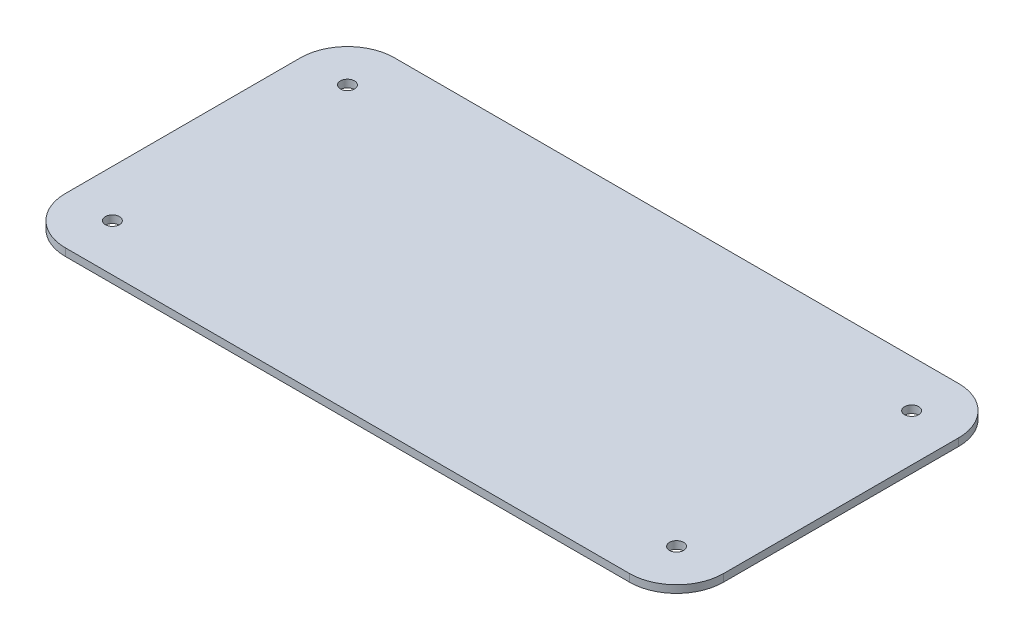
ISO-10303-21;
HEADER;
FILE_DESCRIPTION(('STEP AP214'),'2;1');
FILE_NAME('part.step','',(''),(''),'','','');
FILE_SCHEMA(('AUTOMOTIVE_DESIGN { 1 0 10303 214 1 1 1 1 }'));
ENDSEC;
DATA;
#1=APPLICATION_CONTEXT('core data for automotive mechanical design processes');
#2=APPLICATION_PROTOCOL_DEFINITION('international standard','automotive_design',2000,#1);
#3=PRODUCT_CONTEXT('',#1,'mechanical');
#4=PRODUCT('Part','Part','',(#3));
#5=PRODUCT_RELATED_PRODUCT_CATEGORY('part','',(#4));
#6=PRODUCT_DEFINITION_FORMATION('','',#4);
#7=PRODUCT_DEFINITION_CONTEXT('part definition',#1,'design');
#8=PRODUCT_DEFINITION('design','',#6,#7);
#9=PRODUCT_DEFINITION_SHAPE('','',#8);
#10=(LENGTH_UNIT() NAMED_UNIT(*) SI_UNIT(.MILLI.,.METRE.));
#11=(NAMED_UNIT(*) PLANE_ANGLE_UNIT() SI_UNIT($,.RADIAN.));
#12=(NAMED_UNIT(*) SI_UNIT($,.STERADIAN.) SOLID_ANGLE_UNIT());
#13=UNCERTAINTY_MEASURE_WITH_UNIT(LENGTH_MEASURE(1.E-05),#10,'distance_accuracy_value','');
#14=(GEOMETRIC_REPRESENTATION_CONTEXT(3) GLOBAL_UNCERTAINTY_ASSIGNED_CONTEXT((#13)) GLOBAL_UNIT_ASSIGNED_CONTEXT((#10,
#11,#12)) REPRESENTATION_CONTEXT('',''));
#15=CARTESIAN_POINT('',(0.,0.,0.));
#16=DIRECTION('',(0.,0.,1.));
#17=DIRECTION('',(1.,0.,0.));
#18=AXIS2_PLACEMENT_3D('',#15,#16,#17);
#19=CARTESIAN_POINT('',(50.,8.,-50.));
#20=DIRECTION('',(0.,-1.,0.));
#21=DIRECTION('',(0.,0.,-1.));
#22=AXIS2_PLACEMENT_3D('',#19,#20,#21);
#23=CYLINDRICAL_SURFACE('',#22,50.);
#24=CARTESIAN_POINT('',(50.,0.,-50.));
#25=DIRECTION('',(0.,1.,0.));
#26=DIRECTION('',(0.,0.,1.));
#27=AXIS2_PLACEMENT_3D('',#24,#25,#26);
#28=CIRCLE('',#27,50.);
#29=CARTESIAN_POINT('',(0.,0.,-50.0000000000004));
#30=VERTEX_POINT('',#29);
#31=CARTESIAN_POINT('',(50.0000000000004,0.,0.));
#32=VERTEX_POINT('',#31);
#33=EDGE_CURVE('E92',#30,#32,#28,.T.);
#34=ORIENTED_EDGE('',*,*,#33,.T.);
#35=DIRECTION('',(0.,-1.,0.));
#36=VECTOR('',#35,1.);
#37=CARTESIAN_POINT('',(50.0000000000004,8.,0.));
#38=LINE('',#37,#36);
#39=CARTESIAN_POINT('',(50.0000000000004,8.,0.));
#40=VERTEX_POINT('',#39);
#41=EDGE_CURVE('E11',#40,#32,#38,.T.);
#42=ORIENTED_EDGE('',*,*,#41,.F.);
#43=CARTESIAN_POINT('',(50.,8.,-50.));
#44=DIRECTION('',(0.,1.,0.));
#45=DIRECTION('',(0.,0.,1.));
#46=AXIS2_PLACEMENT_3D('',#43,#44,#45);
#47=CIRCLE('',#46,50.);
#48=CARTESIAN_POINT('',(0.,8.,-50.0000000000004));
#49=VERTEX_POINT('',#48);
#50=EDGE_CURVE('E124',#49,#40,#47,.T.);
#51=ORIENTED_EDGE('',*,*,#50,.F.);
#52=DIRECTION('',(0.,-1.,0.));
#53=VECTOR('',#52,1.);
#54=CARTESIAN_POINT('',(0.,8.,-50.0000000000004));
#55=LINE('',#54,#53);
#56=EDGE_CURVE('E105',#49,#30,#55,.T.);
#57=ORIENTED_EDGE('',*,*,#56,.T.);
#58=EDGE_LOOP('',(#34,#42,#51,#57));
#59=FACE_BOUND('',#58,.T.);
#60=ADVANCED_FACE('F24',(#59),#23,.T.);
#61=CARTESIAN_POINT('',(50.0000000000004,8.,0.));
#62=DIRECTION('',(0.,0.,-1.));
#63=DIRECTION('',(-1.,0.,0.));
#64=AXIS2_PLACEMENT_3D('',#61,#62,#63);
#65=PLANE('',#64);
#66=DIRECTION('',(1.,0.,0.));
#67=VECTOR('',#66,1.);
#68=CARTESIAN_POINT('',(50.0000000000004,0.,0.));
#69=LINE('',#68,#67);
#70=CARTESIAN_POINT('',(650.,0.,0.));
#71=VERTEX_POINT('',#70);
#72=EDGE_CURVE('E88',#32,#71,#69,.T.);
#73=ORIENTED_EDGE('',*,*,#72,.T.);
#74=DIRECTION('',(0.,-1.,0.));
#75=VECTOR('',#74,1.);
#76=CARTESIAN_POINT('',(650.,8.,0.));
#77=LINE('',#76,#75);
#78=CARTESIAN_POINT('',(650.,8.,0.));
#79=VERTEX_POINT('',#78);
#80=EDGE_CURVE('E31',#79,#71,#77,.T.);
#81=ORIENTED_EDGE('',*,*,#80,.F.);
#82=DIRECTION('',(1.,0.,0.));
#83=VECTOR('',#82,1.);
#84=CARTESIAN_POINT('',(50.0000000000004,8.,0.));
#85=LINE('',#84,#83);
#86=EDGE_CURVE('E101',#40,#79,#85,.T.);
#87=ORIENTED_EDGE('',*,*,#86,.F.);
#88=ORIENTED_EDGE('',*,*,#41,.T.);
#89=EDGE_LOOP('',(#73,#81,#87,#88));
#90=FACE_BOUND('',#89,.T.);
#91=ADVANCED_FACE('F100',(#90),#65,.F.);
#92=CARTESIAN_POINT('',(650.,8.,-50.));
#93=DIRECTION('',(0.,-1.,0.));
#94=DIRECTION('',(0.,0.,-1.));
#95=AXIS2_PLACEMENT_3D('',#92,#93,#94);
#96=CYLINDRICAL_SURFACE('',#95,50.);
#97=CARTESIAN_POINT('',(650.,0.,-50.));
#98=DIRECTION('',(0.,1.,0.));
#99=DIRECTION('',(0.,0.,1.));
#100=AXIS2_PLACEMENT_3D('',#97,#98,#99);
#101=CIRCLE('',#100,50.);
#102=CARTESIAN_POINT('',(700.,0.,-50.0000000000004));
#103=VERTEX_POINT('',#102);
#104=EDGE_CURVE('E94',#71,#103,#101,.T.);
#105=ORIENTED_EDGE('',*,*,#104,.T.);
#106=DIRECTION('',(0.,-1.,0.));
#107=VECTOR('',#106,1.);
#108=CARTESIAN_POINT('',(700.,8.,-50.0000000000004));
#109=LINE('',#108,#107);
#110=CARTESIAN_POINT('',(700.,8.,-50.0000000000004));
#111=VERTEX_POINT('',#110);
#112=EDGE_CURVE('E150',#111,#103,#109,.T.);
#113=ORIENTED_EDGE('',*,*,#112,.F.);
#114=CARTESIAN_POINT('',(650.,8.,-50.));
#115=DIRECTION('',(0.,1.,0.));
#116=DIRECTION('',(0.,0.,1.));
#117=AXIS2_PLACEMENT_3D('',#114,#115,#116);
#118=CIRCLE('',#117,50.);
#119=EDGE_CURVE('E127',#79,#111,#118,.T.);
#120=ORIENTED_EDGE('',*,*,#119,.F.);
#121=ORIENTED_EDGE('',*,*,#80,.T.);
#122=EDGE_LOOP('',(#105,#113,#120,#121));
#123=FACE_BOUND('',#122,.T.);
#124=ADVANCED_FACE('F154',(#123),#96,.T.);
#125=CARTESIAN_POINT('',(700.,8.,-50.0000000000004));
#126=DIRECTION('',(-1.,0.,0.));
#127=DIRECTION('',(0.,0.,1.));
#128=AXIS2_PLACEMENT_3D('',#125,#126,#127);
#129=PLANE('',#128);
#130=DIRECTION('',(0.,0.,-1.));
#131=VECTOR('',#130,1.);
#132=CARTESIAN_POINT('',(700.,0.,-50.0000000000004));
#133=LINE('',#132,#131);
#134=CARTESIAN_POINT('',(700.,0.,-300.));
#135=VERTEX_POINT('',#134);
#136=EDGE_CURVE('E114',#103,#135,#133,.T.);
#137=ORIENTED_EDGE('',*,*,#136,.T.);
#138=DIRECTION('',(0.,-1.,0.));
#139=VECTOR('',#138,1.);
#140=CARTESIAN_POINT('',(700.,8.,-300.));
#141=LINE('',#140,#139);
#142=CARTESIAN_POINT('',(700.,8.,-300.));
#143=VERTEX_POINT('',#142);
#144=EDGE_CURVE('E147',#143,#135,#141,.T.);
#145=ORIENTED_EDGE('',*,*,#144,.F.);
#146=DIRECTION('',(0.,0.,-1.));
#147=VECTOR('',#146,1.);
#148=CARTESIAN_POINT('',(700.,8.,-50.0000000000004));
#149=LINE('',#148,#147);
#150=EDGE_CURVE('E129',#111,#143,#149,.T.);
#151=ORIENTED_EDGE('',*,*,#150,.F.);
#152=ORIENTED_EDGE('',*,*,#112,.T.);
#153=EDGE_LOOP('',(#137,#145,#151,#152));
#154=FACE_BOUND('',#153,.T.);
#155=ADVANCED_FACE('F162',(#154),#129,.F.);
#156=CARTESIAN_POINT('',(650.,8.,-300.));
#157=DIRECTION('',(0.,-1.,0.));
#158=DIRECTION('',(0.,0.,-1.));
#159=AXIS2_PLACEMENT_3D('',#156,#157,#158);
#160=CYLINDRICAL_SURFACE('',#159,50.);
#161=CARTESIAN_POINT('',(650.,0.,-300.));
#162=DIRECTION('',(0.,1.,0.));
#163=DIRECTION('',(0.,0.,1.));
#164=AXIS2_PLACEMENT_3D('',#161,#162,#163);
#165=CIRCLE('',#164,50.);
#166=CARTESIAN_POINT('',(650.,0.,-350.));
#167=VERTEX_POINT('',#166);
#168=EDGE_CURVE('E116',#135,#167,#165,.T.);
#169=ORIENTED_EDGE('',*,*,#168,.T.);
#170=DIRECTION('',(0.,-1.,0.));
#171=VECTOR('',#170,1.);
#172=CARTESIAN_POINT('',(650.,8.,-350.));
#173=LINE('',#172,#171);
#174=CARTESIAN_POINT('',(650.,8.,-350.));
#175=VERTEX_POINT('',#174);
#176=EDGE_CURVE('E144',#175,#167,#173,.T.);
#177=ORIENTED_EDGE('',*,*,#176,.F.);
#178=CARTESIAN_POINT('',(650.,8.,-300.));
#179=DIRECTION('',(0.,1.,0.));
#180=DIRECTION('',(0.,0.,1.));
#181=AXIS2_PLACEMENT_3D('',#178,#179,#180);
#182=CIRCLE('',#181,50.);
#183=EDGE_CURVE('E131',#143,#175,#182,.T.);
#184=ORIENTED_EDGE('',*,*,#183,.F.);
#185=ORIENTED_EDGE('',*,*,#144,.T.);
#186=EDGE_LOOP('',(#169,#177,#184,#185));
#187=FACE_BOUND('',#186,.T.);
#188=ADVANCED_FACE('F165',(#187),#160,.T.);
#189=CARTESIAN_POINT('',(50.0000000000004,8.,-350.));
#190=DIRECTION('',(0.,0.,1.));
#191=DIRECTION('',(1.,0.,0.));
#192=AXIS2_PLACEMENT_3D('',#189,#190,#191);
#193=PLANE('',#192);
#194=DIRECTION('',(-1.,0.,0.));
#195=VECTOR('',#194,1.);
#196=CARTESIAN_POINT('',(50.0000000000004,0.,-350.));
#197=LINE('',#196,#195);
#198=CARTESIAN_POINT('',(50.0000000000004,0.,-350.));
#199=VERTEX_POINT('',#198);
#200=EDGE_CURVE('E118',#167,#199,#197,.T.);
#201=ORIENTED_EDGE('',*,*,#200,.T.);
#202=DIRECTION('',(0.,-1.,0.));
#203=VECTOR('',#202,1.);
#204=CARTESIAN_POINT('',(50.0000000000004,8.,-350.));
#205=LINE('',#204,#203);
#206=CARTESIAN_POINT('',(50.0000000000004,8.,-350.));
#207=VERTEX_POINT('',#206);
#208=EDGE_CURVE('E141',#207,#199,#205,.T.);
#209=ORIENTED_EDGE('',*,*,#208,.F.);
#210=DIRECTION('',(-1.,0.,0.));
#211=VECTOR('',#210,1.);
#212=CARTESIAN_POINT('',(50.0000000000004,8.,-350.));
#213=LINE('',#212,#211);
#214=EDGE_CURVE('E133',#175,#207,#213,.T.);
#215=ORIENTED_EDGE('',*,*,#214,.F.);
#216=ORIENTED_EDGE('',*,*,#176,.T.);
#217=EDGE_LOOP('',(#201,#209,#215,#216));
#218=FACE_BOUND('',#217,.T.);
#219=ADVANCED_FACE('F170',(#218),#193,.F.);
#220=CARTESIAN_POINT('',(50.,8.,-300.));
#221=DIRECTION('',(0.,-1.,0.));
#222=DIRECTION('',(0.,0.,-1.));
#223=AXIS2_PLACEMENT_3D('',#220,#221,#222);
#224=CYLINDRICAL_SURFACE('',#223,50.);
#225=CARTESIAN_POINT('',(50.,0.,-300.));
#226=DIRECTION('',(0.,1.,0.));
#227=DIRECTION('',(0.,0.,1.));
#228=AXIS2_PLACEMENT_3D('',#225,#226,#227);
#229=CIRCLE('',#228,50.);
#230=CARTESIAN_POINT('',(0.,0.,-300.));
#231=VERTEX_POINT('',#230);
#232=EDGE_CURVE('E120',#199,#231,#229,.T.);
#233=ORIENTED_EDGE('',*,*,#232,.T.);
#234=DIRECTION('',(0.,-1.,0.));
#235=VECTOR('',#234,1.);
#236=CARTESIAN_POINT('',(0.,8.,-300.));
#237=LINE('',#236,#235);
#238=CARTESIAN_POINT('',(0.,8.,-300.));
#239=VERTEX_POINT('',#238);
#240=EDGE_CURVE('E138',#239,#231,#237,.T.);
#241=ORIENTED_EDGE('',*,*,#240,.F.);
#242=CARTESIAN_POINT('',(50.,8.,-300.));
#243=DIRECTION('',(0.,1.,0.));
#244=DIRECTION('',(0.,0.,1.));
#245=AXIS2_PLACEMENT_3D('',#242,#243,#244);
#246=CIRCLE('',#245,50.);
#247=EDGE_CURVE('E43',#207,#239,#246,.T.);
#248=ORIENTED_EDGE('',*,*,#247,.F.);
#249=ORIENTED_EDGE('',*,*,#208,.T.);
#250=EDGE_LOOP('',(#233,#241,#248,#249));
#251=FACE_BOUND('',#250,.T.);
#252=ADVANCED_FACE('F173',(#251),#224,.T.);
#253=CARTESIAN_POINT('',(0.,8.,-50.0000000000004));
#254=DIRECTION('',(1.,0.,0.));
#255=DIRECTION('',(0.,0.,-1.));
#256=AXIS2_PLACEMENT_3D('',#253,#254,#255);
#257=PLANE('',#256);
#258=DIRECTION('',(0.,0.,1.));
#259=VECTOR('',#258,1.);
#260=CARTESIAN_POINT('',(0.,0.,-50.0000000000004));
#261=LINE('',#260,#259);
#262=EDGE_CURVE('E122',#231,#30,#261,.T.);
#263=ORIENTED_EDGE('',*,*,#262,.T.);
#264=ORIENTED_EDGE('',*,*,#56,.F.);
#265=DIRECTION('',(0.,0.,1.));
#266=VECTOR('',#265,1.);
#267=CARTESIAN_POINT('',(0.,8.,-50.0000000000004));
#268=LINE('',#267,#266);
#269=EDGE_CURVE('E38',#239,#49,#268,.T.);
#270=ORIENTED_EDGE('',*,*,#269,.F.);
#271=ORIENTED_EDGE('',*,*,#240,.T.);
#272=EDGE_LOOP('',(#263,#264,#270,#271));
#273=FACE_BOUND('',#272,.T.);
#274=ADVANCED_FACE('F175',(#273),#257,.F.);
#275=CARTESIAN_POINT('',(50.,8.,-50.));
#276=DIRECTION('',(0.,1.,0.));
#277=DIRECTION('',(0.,0.,1.));
#278=AXIS2_PLACEMENT_3D('',#275,#276,#277);
#279=PLANE('',#278);
#280=CARTESIAN_POINT('',(650.,8.,-300.));
#281=DIRECTION('',(0.,1.,0.));
#282=DIRECTION('',(0.,0.,1.));
#283=AXIS2_PLACEMENT_3D('',#280,#281,#282);
#284=CIRCLE('',#283,7.50000000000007);
#285=CARTESIAN_POINT('',(650.,8.,-292.5));
#286=VERTEX_POINT('',#285);
#287=EDGE_CURVE('E260',#286,#286,#284,.T.);
#288=ORIENTED_EDGE('',*,*,#287,.F.);
#289=EDGE_LOOP('',(#288));
#290=FACE_BOUND('',#289,.T.);
#291=CARTESIAN_POINT('',(650.,8.,-50.));
#292=DIRECTION('',(0.,1.,0.));
#293=DIRECTION('',(0.,0.,1.));
#294=AXIS2_PLACEMENT_3D('',#291,#292,#293);
#295=CIRCLE('',#294,7.50000000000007);
#296=CARTESIAN_POINT('',(650.,8.,-42.4999999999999));
#297=VERTEX_POINT('',#296);
#298=EDGE_CURVE('E262',#297,#297,#295,.T.);
#299=ORIENTED_EDGE('',*,*,#298,.F.);
#300=EDGE_LOOP('',(#299));
#301=FACE_BOUND('',#300,.T.);
#302=CARTESIAN_POINT('',(50.,8.,-300.));
#303=DIRECTION('',(0.,1.,0.));
#304=DIRECTION('',(0.,0.,1.));
#305=AXIS2_PLACEMENT_3D('',#302,#303,#304);
#306=CIRCLE('',#305,7.50000000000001);
#307=CARTESIAN_POINT('',(50.,8.,-292.5));
#308=VERTEX_POINT('',#307);
#309=EDGE_CURVE('E270',#308,#308,#306,.T.);
#310=ORIENTED_EDGE('',*,*,#309,.F.);
#311=EDGE_LOOP('',(#310));
#312=FACE_BOUND('',#311,.T.);
#313=CARTESIAN_POINT('',(50.,8.,-50.));
#314=DIRECTION('',(0.,1.,0.));
#315=DIRECTION('',(0.,0.,1.));
#316=AXIS2_PLACEMENT_3D('',#313,#314,#315);
#317=CIRCLE('',#316,7.50000000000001);
#318=CARTESIAN_POINT('',(50.,8.,-42.5));
#319=VERTEX_POINT('',#318);
#320=EDGE_CURVE('E109',#319,#319,#317,.T.);
#321=ORIENTED_EDGE('',*,*,#320,.F.);
#322=EDGE_LOOP('',(#321));
#323=FACE_BOUND('',#322,.T.);
#324=ORIENTED_EDGE('',*,*,#50,.T.);
#325=ORIENTED_EDGE('',*,*,#86,.T.);
#326=ORIENTED_EDGE('',*,*,#119,.T.);
#327=ORIENTED_EDGE('',*,*,#150,.T.);
#328=ORIENTED_EDGE('',*,*,#183,.T.);
#329=ORIENTED_EDGE('',*,*,#214,.T.);
#330=ORIENTED_EDGE('',*,*,#247,.T.);
#331=ORIENTED_EDGE('',*,*,#269,.T.);
#332=EDGE_LOOP('',(#324,#325,#326,#327,#328,#329,#330,#331));
#333=FACE_BOUND('',#332,.T.);
#334=ADVANCED_FACE('F157',(#290,#301,#312,#323,#333),#279,.T.);
#335=CARTESIAN_POINT('',(50.,0.,-50.));
#336=DIRECTION('',(0.,1.,0.));
#337=DIRECTION('',(0.,0.,1.));
#338=AXIS2_PLACEMENT_3D('',#335,#336,#337);
#339=PLANE('',#338);
#340=CARTESIAN_POINT('',(650.,0.,-300.));
#341=DIRECTION('',(0.,1.,0.));
#342=DIRECTION('',(0.,0.,1.));
#343=AXIS2_PLACEMENT_3D('',#340,#341,#342);
#344=CIRCLE('',#343,7.50000000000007);
#345=CARTESIAN_POINT('',(650.,0.,-292.5));
#346=VERTEX_POINT('',#345);
#347=EDGE_CURVE('E257',#346,#346,#344,.T.);
#348=ORIENTED_EDGE('',*,*,#347,.T.);
#349=EDGE_LOOP('',(#348));
#350=FACE_BOUND('',#349,.T.);
#351=CARTESIAN_POINT('',(650.,0.,-50.));
#352=DIRECTION('',(0.,1.,0.));
#353=DIRECTION('',(0.,0.,1.));
#354=AXIS2_PLACEMENT_3D('',#351,#352,#353);
#355=CIRCLE('',#354,7.50000000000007);
#356=CARTESIAN_POINT('',(650.,0.,-42.4999999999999));
#357=VERTEX_POINT('',#356);
#358=EDGE_CURVE('E267',#357,#357,#355,.T.);
#359=ORIENTED_EDGE('',*,*,#358,.T.);
#360=EDGE_LOOP('',(#359));
#361=FACE_BOUND('',#360,.T.);
#362=CARTESIAN_POINT('',(50.,0.,-300.));
#363=DIRECTION('',(0.,1.,0.));
#364=DIRECTION('',(0.,0.,1.));
#365=AXIS2_PLACEMENT_3D('',#362,#363,#364);
#366=CIRCLE('',#365,7.50000000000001);
#367=CARTESIAN_POINT('',(50.,0.,-292.5));
#368=VERTEX_POINT('',#367);
#369=EDGE_CURVE('E273',#368,#368,#366,.T.);
#370=ORIENTED_EDGE('',*,*,#369,.T.);
#371=EDGE_LOOP('',(#370));
#372=FACE_BOUND('',#371,.T.);
#373=CARTESIAN_POINT('',(50.,0.,-50.));
#374=DIRECTION('',(0.,1.,0.));
#375=DIRECTION('',(0.,0.,1.));
#376=AXIS2_PLACEMENT_3D('',#373,#374,#375);
#377=CIRCLE('',#376,7.50000000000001);
#378=CARTESIAN_POINT('',(50.,0.,-42.5));
#379=VERTEX_POINT('',#378);
#380=EDGE_CURVE('E106',#379,#379,#377,.T.);
#381=ORIENTED_EDGE('',*,*,#380,.T.);
#382=EDGE_LOOP('',(#381));
#383=FACE_BOUND('',#382,.T.);
#384=ORIENTED_EDGE('',*,*,#33,.F.);
#385=ORIENTED_EDGE('',*,*,#262,.F.);
#386=ORIENTED_EDGE('',*,*,#232,.F.);
#387=ORIENTED_EDGE('',*,*,#200,.F.);
#388=ORIENTED_EDGE('',*,*,#168,.F.);
#389=ORIENTED_EDGE('',*,*,#136,.F.);
#390=ORIENTED_EDGE('',*,*,#104,.F.);
#391=ORIENTED_EDGE('',*,*,#72,.F.);
#392=EDGE_LOOP('',(#384,#385,#386,#387,#388,#389,#390,#391));
#393=FACE_BOUND('',#392,.T.);
#394=ADVANCED_FACE('F89',(#350,#361,#372,#383,#393),#339,.F.);
#395=CARTESIAN_POINT('',(50.,0.,-50.));
#396=DIRECTION('',(0.,1.,0.));
#397=DIRECTION('',(0.,0.,1.));
#398=AXIS2_PLACEMENT_3D('',#395,#396,#397);
#399=CYLINDRICAL_SURFACE('',#398,7.50000000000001);
#400=ORIENTED_EDGE('',*,*,#380,.F.);
#401=EDGE_LOOP('',(#400));
#402=FACE_BOUND('',#401,.T.);
#403=ORIENTED_EDGE('',*,*,#320,.T.);
#404=EDGE_LOOP('',(#403));
#405=FACE_BOUND('',#404,.T.);
#406=ADVANCED_FACE('F220',(#402,#405),#399,.F.);
#407=CARTESIAN_POINT('',(50.,0.,-300.));
#408=DIRECTION('',(0.,1.,0.));
#409=DIRECTION('',(0.,0.,1.));
#410=AXIS2_PLACEMENT_3D('',#407,#408,#409);
#411=CYLINDRICAL_SURFACE('',#410,7.50000000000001);
#412=ORIENTED_EDGE('',*,*,#369,.F.);
#413=EDGE_LOOP('',(#412));
#414=FACE_BOUND('',#413,.T.);
#415=ORIENTED_EDGE('',*,*,#309,.T.);
#416=EDGE_LOOP('',(#415));
#417=FACE_BOUND('',#416,.T.);
#418=ADVANCED_FACE('F228',(#414,#417),#411,.F.);
#419=CARTESIAN_POINT('',(650.,0.,-50.));
#420=DIRECTION('',(0.,1.,0.));
#421=DIRECTION('',(0.,0.,1.));
#422=AXIS2_PLACEMENT_3D('',#419,#420,#421);
#423=CYLINDRICAL_SURFACE('',#422,7.50000000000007);
#424=ORIENTED_EDGE('',*,*,#358,.F.);
#425=EDGE_LOOP('',(#424));
#426=FACE_BOUND('',#425,.T.);
#427=ORIENTED_EDGE('',*,*,#298,.T.);
#428=EDGE_LOOP('',(#427));
#429=FACE_BOUND('',#428,.T.);
#430=ADVANCED_FACE('F236',(#426,#429),#423,.F.);
#431=CARTESIAN_POINT('',(650.,0.,-300.));
#432=DIRECTION('',(0.,1.,0.));
#433=DIRECTION('',(0.,0.,1.));
#434=AXIS2_PLACEMENT_3D('',#431,#432,#433);
#435=CYLINDRICAL_SURFACE('',#434,7.50000000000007);
#436=ORIENTED_EDGE('',*,*,#347,.F.);
#437=EDGE_LOOP('',(#436));
#438=FACE_BOUND('',#437,.T.);
#439=ORIENTED_EDGE('',*,*,#287,.T.);
#440=EDGE_LOOP('',(#439));
#441=FACE_BOUND('',#440,.T.);
#442=ADVANCED_FACE('F244',(#438,#441),#435,.F.);
#443=CLOSED_SHELL('',(#60,#91,#124,#155,#188,#219,#252,#274,#334,#394,#406,#418,#430,#442));
#444=MANIFOLD_SOLID_BREP('B2',#443);
#445=ADVANCED_BREP_SHAPE_REPRESENTATION('',(#18,#444),#14);
#446=SHAPE_DEFINITION_REPRESENTATION(#9,#445);
ENDSEC;
END-ISO-10303-21;
